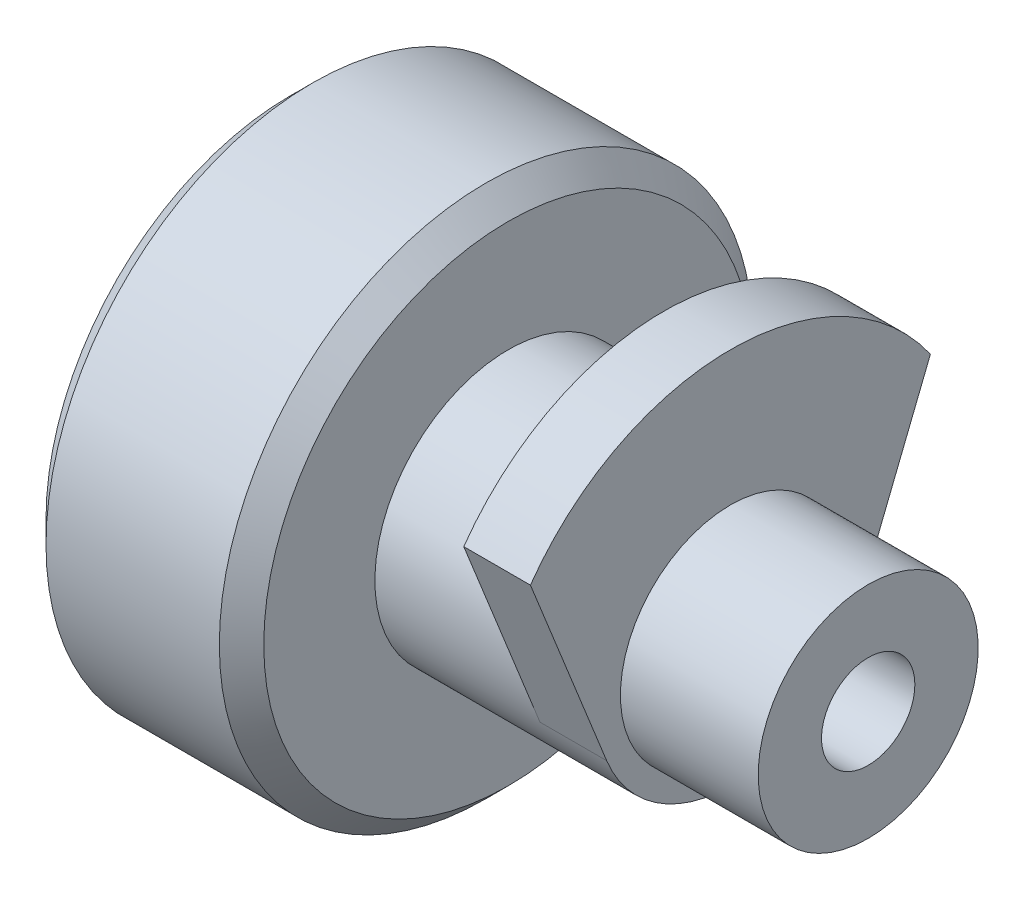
ISO-10303-21;
HEADER;
FILE_DESCRIPTION(('STEP AP214'),'2;1');
FILE_NAME('part.step','',(''),(''),'','','');
FILE_SCHEMA(('AUTOMOTIVE_DESIGN { 1 0 10303 214 1 1 1 1 }'));
ENDSEC;
DATA;
#1=APPLICATION_CONTEXT('core data for automotive mechanical design processes');
#2=APPLICATION_PROTOCOL_DEFINITION('international standard','automotive_design',2000,#1);
#3=PRODUCT_CONTEXT('',#1,'mechanical');
#4=PRODUCT('Part','Part','',(#3));
#5=PRODUCT_RELATED_PRODUCT_CATEGORY('part','',(#4));
#6=PRODUCT_DEFINITION_FORMATION('','',#4);
#7=PRODUCT_DEFINITION_CONTEXT('part definition',#1,'design');
#8=PRODUCT_DEFINITION('design','',#6,#7);
#9=PRODUCT_DEFINITION_SHAPE('','',#8);
#10=(LENGTH_UNIT() NAMED_UNIT(*) SI_UNIT(.MILLI.,.METRE.));
#11=(NAMED_UNIT(*) PLANE_ANGLE_UNIT() SI_UNIT($,.RADIAN.));
#12=(NAMED_UNIT(*) SI_UNIT($,.STERADIAN.) SOLID_ANGLE_UNIT());
#13=UNCERTAINTY_MEASURE_WITH_UNIT(LENGTH_MEASURE(1.E-05),#10,'distance_accuracy_value','');
#14=(GEOMETRIC_REPRESENTATION_CONTEXT(3) GLOBAL_UNCERTAINTY_ASSIGNED_CONTEXT((#13)) GLOBAL_UNIT_ASSIGNED_CONTEXT((#10,
#11,#12)) REPRESENTATION_CONTEXT('',''));
#15=CARTESIAN_POINT('',(0.,0.,0.));
#16=DIRECTION('',(0.,0.,1.));
#17=DIRECTION('',(1.,0.,0.));
#18=AXIS2_PLACEMENT_3D('',#15,#16,#17);
#19=CARTESIAN_POINT('',(16.8,0.,0.));
#20=DIRECTION('',(-1.,0.,0.));
#21=DIRECTION('',(0.,-1.,0.));
#22=AXIS2_PLACEMENT_3D('',#19,#20,#21);
#23=CYLINDRICAL_SURFACE('',#22,6.);
#24=CARTESIAN_POINT('',(9.8,0.,0.));
#25=DIRECTION('',(-1.,0.,0.));
#26=DIRECTION('',(0.,-1.,0.));
#27=AXIS2_PLACEMENT_3D('',#24,#25,#26);
#28=CIRCLE('',#27,6.);
#29=CARTESIAN_POINT('',(9.79999999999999,-5.99999999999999,0.));
#30=VERTEX_POINT('',#29);
#31=EDGE_CURVE('E128',#30,#30,#28,.T.);
#32=ORIENTED_EDGE('',*,*,#31,.F.);
#33=EDGE_LOOP('',(#32));
#34=FACE_BOUND('',#33,.T.);
#35=CARTESIAN_POINT('',(16.8,0.,0.));
#36=DIRECTION('',(1.,0.,0.));
#37=DIRECTION('',(0.,1.,0.));
#38=AXIS2_PLACEMENT_3D('',#35,#36,#37);
#39=CIRCLE('',#38,6.);
#40=CARTESIAN_POINT('',(16.8,-2.23282156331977,-5.56906705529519));
#41=VERTEX_POINT('',#40);
#42=CARTESIAN_POINT('',(16.8,-2.23282156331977,5.56906705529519));
#43=VERTEX_POINT('',#42);
#44=EDGE_CURVE('E51',#41,#43,#39,.T.);
#45=ORIENTED_EDGE('',*,*,#44,.F.);
#46=DIRECTION('',(1.,0.,0.));
#47=VECTOR('',#46,1.);
#48=CARTESIAN_POINT('',(16.8,-2.23282156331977,-5.56906705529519));
#49=LINE('',#48,#47);
#50=CARTESIAN_POINT('',(19.8,-2.23282156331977,-5.56906705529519));
#51=VERTEX_POINT('',#50);
#52=EDGE_CURVE('E103',#41,#51,#49,.T.);
#53=ORIENTED_EDGE('',*,*,#52,.T.);
#54=CARTESIAN_POINT('',(19.8,0.,0.));
#55=DIRECTION('',(-1.,0.,0.));
#56=DIRECTION('',(0.,-1.,0.));
#57=AXIS2_PLACEMENT_3D('',#54,#55,#56);
#58=CIRCLE('',#57,6.);
#59=CARTESIAN_POINT('',(19.8,-2.23282156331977,5.56906705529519));
#60=VERTEX_POINT('',#59);
#61=EDGE_CURVE('E131',#51,#60,#58,.T.);
#62=ORIENTED_EDGE('',*,*,#61,.T.);
#63=DIRECTION('',(1.,0.,0.));
#64=VECTOR('',#63,1.);
#65=CARTESIAN_POINT('',(16.8,-2.23282156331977,5.56906705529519));
#66=LINE('',#65,#64);
#67=EDGE_CURVE('E47',#43,#60,#66,.T.);
#68=ORIENTED_EDGE('',*,*,#67,.F.);
#69=EDGE_LOOP('',(#45,#53,#62,#68));
#70=FACE_BOUND('',#69,.T.);
#71=ADVANCED_FACE('F31',(#34,#70),#23,.T.);
#72=CARTESIAN_POINT('',(26.,0.,0.));
#73=DIRECTION('',(-1.,0.,0.));
#74=DIRECTION('',(0.,-1.,0.));
#75=AXIS2_PLACEMENT_3D('',#72,#73,#74);
#76=PLANE('',#75);
#77=CARTESIAN_POINT('',(26.,0.,0.));
#78=DIRECTION('',(1.,0.,0.));
#79=DIRECTION('',(0.,0.,-1.));
#80=AXIS2_PLACEMENT_3D('',#77,#78,#79);
#81=CIRCLE('',#80,2.09999999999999);
#82=CARTESIAN_POINT('',(26.,0.,-2.09999999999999));
#83=VERTEX_POINT('',#82);
#84=EDGE_CURVE('E107',#83,#83,#81,.T.);
#85=ORIENTED_EDGE('',*,*,#84,.F.);
#86=EDGE_LOOP('',(#85));
#87=FACE_BOUND('',#86,.T.);
#88=CARTESIAN_POINT('',(26.,0.,0.));
#89=DIRECTION('',(-1.,0.,0.));
#90=DIRECTION('',(0.,-1.,0.));
#91=AXIS2_PLACEMENT_3D('',#88,#89,#90);
#92=CIRCLE('',#91,4.95);
#93=CARTESIAN_POINT('',(26.,-4.95,0.));
#94=VERTEX_POINT('',#93);
#95=EDGE_CURVE('E11',#94,#94,#92,.T.);
#96=ORIENTED_EDGE('',*,*,#95,.F.);
#97=EDGE_LOOP('',(#96));
#98=FACE_BOUND('',#97,.T.);
#99=ADVANCED_FACE('F33',(#87,#98),#76,.F.);
#100=CARTESIAN_POINT('',(16.8,0.,0.));
#101=DIRECTION('',(-1.,0.,0.));
#102=DIRECTION('',(0.,-1.,0.));
#103=AXIS2_PLACEMENT_3D('',#100,#101,#102);
#104=CYLINDRICAL_SURFACE('',#103,4.95);
#105=CARTESIAN_POINT('',(19.8,0.,0.));
#106=DIRECTION('',(-1.,0.,0.));
#107=DIRECTION('',(0.,-1.,0.));
#108=AXIS2_PLACEMENT_3D('',#105,#106,#107);
#109=CIRCLE('',#108,4.95);
#110=CARTESIAN_POINT('',(19.8,-4.95,0.));
#111=VERTEX_POINT('',#110);
#112=EDGE_CURVE('E40',#111,#111,#109,.T.);
#113=ORIENTED_EDGE('',*,*,#112,.F.);
#114=EDGE_LOOP('',(#113));
#115=FACE_BOUND('',#114,.T.);
#116=ORIENTED_EDGE('',*,*,#95,.T.);
#117=EDGE_LOOP('',(#116));
#118=FACE_BOUND('',#117,.T.);
#119=ADVANCED_FACE('F138',(#115,#118),#104,.T.);
#120=CARTESIAN_POINT('',(19.8,4.95,0.));
#121=DIRECTION('',(-1.,0.,0.));
#122=DIRECTION('',(0.,-1.,0.));
#123=AXIS2_PLACEMENT_3D('',#120,#121,#122);
#124=PLANE('',#123);
#125=ORIENTED_EDGE('',*,*,#61,.F.);
#126=DIRECTION('',(0.,0.928177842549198,-0.372136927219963));
#127=VECTOR('',#126,1.);
#128=CARTESIAN_POINT('',(19.8,6.32455532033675,-9.));
#129=LINE('',#128,#127);
#130=CARTESIAN_POINT('',(19.8,6.32455532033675,-9.));
#131=VERTEX_POINT('',#130);
#132=EDGE_CURVE('E93',#51,#131,#129,.T.);
#133=ORIENTED_EDGE('',*,*,#132,.T.);
#134=CARTESIAN_POINT('',(19.8,0.,0.));
#135=DIRECTION('',(1.,0.,0.));
#136=DIRECTION('',(0.,1.,0.));
#137=AXIS2_PLACEMENT_3D('',#134,#135,#136);
#138=CIRCLE('',#137,11.);
#139=CARTESIAN_POINT('',(19.8,6.32455532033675,9.));
#140=VERTEX_POINT('',#139);
#141=EDGE_CURVE('E99',#131,#140,#138,.T.);
#142=ORIENTED_EDGE('',*,*,#141,.T.);
#143=DIRECTION('',(0.,-0.928177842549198,-0.372136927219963));
#144=VECTOR('',#143,1.);
#145=CARTESIAN_POINT('',(19.8,6.32455532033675,9.));
#146=LINE('',#145,#144);
#147=EDGE_CURVE('E77',#140,#60,#146,.T.);
#148=ORIENTED_EDGE('',*,*,#147,.T.);
#149=EDGE_LOOP('',(#125,#133,#142,#148));
#150=FACE_BOUND('',#149,.T.);
#151=ORIENTED_EDGE('',*,*,#112,.T.);
#152=EDGE_LOOP('',(#151));
#153=FACE_BOUND('',#152,.T.);
#154=ADVANCED_FACE('F136',(#150,#153),#124,.F.);
#155=CARTESIAN_POINT('',(9.8,6.,0.));
#156=DIRECTION('',(-1.,0.,0.));
#157=DIRECTION('',(0.,-1.,0.));
#158=AXIS2_PLACEMENT_3D('',#155,#156,#157);
#159=PLANE('',#158);
#160=CARTESIAN_POINT('',(9.8,0.,0.));
#161=DIRECTION('',(-1.,0.,0.));
#162=DIRECTION('',(0.,-1.,0.));
#163=AXIS2_PLACEMENT_3D('',#160,#161,#162);
#164=CIRCLE('',#163,11.);
#165=CARTESIAN_POINT('',(9.79999999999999,-11.,0.));
#166=VERTEX_POINT('',#165);
#167=EDGE_CURVE('E125',#166,#166,#164,.T.);
#168=ORIENTED_EDGE('',*,*,#167,.F.);
#169=EDGE_LOOP('',(#168));
#170=FACE_BOUND('',#169,.T.);
#171=ORIENTED_EDGE('',*,*,#31,.T.);
#172=EDGE_LOOP('',(#171));
#173=FACE_BOUND('',#172,.T.);
#174=ADVANCED_FACE('F189',(#170,#173),#159,.F.);
#175=CARTESIAN_POINT('',(9.8,0.,0.));
#176=DIRECTION('',(-1.,0.,0.));
#177=DIRECTION('',(0.,-1.,0.));
#178=AXIS2_PLACEMENT_3D('',#175,#176,#177);
#179=CONICAL_SURFACE('',#178,11.,0.785398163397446);
#180=CARTESIAN_POINT('',(8.79999999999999,0.,0.));
#181=DIRECTION('',(-1.,0.,0.));
#182=DIRECTION('',(0.,-1.,0.));
#183=AXIS2_PLACEMENT_3D('',#180,#181,#182);
#184=CIRCLE('',#183,12.);
#185=CARTESIAN_POINT('',(8.79999999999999,-12.,0.));
#186=VERTEX_POINT('',#185);
#187=EDGE_CURVE('E122',#186,#186,#184,.T.);
#188=ORIENTED_EDGE('',*,*,#187,.F.);
#189=EDGE_LOOP('',(#188));
#190=FACE_BOUND('',#189,.T.);
#191=ORIENTED_EDGE('',*,*,#167,.T.);
#192=EDGE_LOOP('',(#191));
#193=FACE_BOUND('',#192,.T.);
#194=ADVANCED_FACE('F185',(#190,#193),#179,.T.);
#195=CARTESIAN_POINT('',(16.8,0.,0.));
#196=DIRECTION('',(-1.,0.,0.));
#197=DIRECTION('',(0.,-1.,0.));
#198=AXIS2_PLACEMENT_3D('',#195,#196,#197);
#199=CYLINDRICAL_SURFACE('',#198,12.);
#200=CARTESIAN_POINT('',(0.99999999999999,0.,0.));
#201=DIRECTION('',(-1.,0.,0.));
#202=DIRECTION('',(0.,-1.,0.));
#203=AXIS2_PLACEMENT_3D('',#200,#201,#202);
#204=CIRCLE('',#203,12.);
#205=CARTESIAN_POINT('',(0.999999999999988,-12.,0.));
#206=VERTEX_POINT('',#205);
#207=EDGE_CURVE('E119',#206,#206,#204,.T.);
#208=ORIENTED_EDGE('',*,*,#207,.F.);
#209=EDGE_LOOP('',(#208));
#210=FACE_BOUND('',#209,.T.);
#211=ORIENTED_EDGE('',*,*,#187,.T.);
#212=EDGE_LOOP('',(#211));
#213=FACE_BOUND('',#212,.T.);
#214=ADVANCED_FACE('F181',(#210,#213),#199,.T.);
#215=CARTESIAN_POINT('',(0.99999999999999,0.,0.));
#216=DIRECTION('',(1.,0.,0.));
#217=DIRECTION('',(0.,1.,0.));
#218=AXIS2_PLACEMENT_3D('',#215,#216,#217);
#219=CONICAL_SURFACE('',#218,12.,0.785398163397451);
#220=CARTESIAN_POINT('',(0.,0.,0.));
#221=DIRECTION('',(-1.,0.,0.));
#222=DIRECTION('',(0.,-1.,0.));
#223=AXIS2_PLACEMENT_3D('',#220,#221,#222);
#224=CIRCLE('',#223,11.);
#225=CARTESIAN_POINT('',(0.,-11.,0.));
#226=VERTEX_POINT('',#225);
#227=EDGE_CURVE('E116',#226,#226,#224,.T.);
#228=ORIENTED_EDGE('',*,*,#227,.F.);
#229=EDGE_LOOP('',(#228));
#230=FACE_BOUND('',#229,.T.);
#231=ORIENTED_EDGE('',*,*,#207,.T.);
#232=EDGE_LOOP('',(#231));
#233=FACE_BOUND('',#232,.T.);
#234=ADVANCED_FACE('F177',(#230,#233),#219,.T.);
#235=CARTESIAN_POINT('',(0.,11.,0.));
#236=DIRECTION('',(1.,0.,0.));
#237=DIRECTION('',(0.,1.,0.));
#238=AXIS2_PLACEMENT_3D('',#235,#236,#237);
#239=PLANE('',#238);
#240=CARTESIAN_POINT('',(0.,0.,0.));
#241=DIRECTION('',(-1.,0.,0.));
#242=DIRECTION('',(0.,-1.,0.));
#243=AXIS2_PLACEMENT_3D('',#240,#241,#242);
#244=CIRCLE('',#243,2.5);
#245=CARTESIAN_POINT('',(0.,-2.49999999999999,0.));
#246=VERTEX_POINT('',#245);
#247=EDGE_CURVE('E113',#246,#246,#244,.T.);
#248=ORIENTED_EDGE('',*,*,#247,.F.);
#249=EDGE_LOOP('',(#248));
#250=FACE_BOUND('',#249,.T.);
#251=ORIENTED_EDGE('',*,*,#227,.T.);
#252=EDGE_LOOP('',(#251));
#253=FACE_BOUND('',#252,.T.);
#254=ADVANCED_FACE('F173',(#250,#253),#239,.F.);
#255=CARTESIAN_POINT('',(16.8,0.,0.));
#256=DIRECTION('',(-1.,0.,0.));
#257=DIRECTION('',(0.,-1.,0.));
#258=AXIS2_PLACEMENT_3D('',#255,#256,#257);
#259=CYLINDRICAL_SURFACE('',#258,2.5);
#260=CARTESIAN_POINT('',(16.8,0.,0.));
#261=DIRECTION('',(-1.,0.,0.));
#262=DIRECTION('',(0.,-1.,0.));
#263=AXIS2_PLACEMENT_3D('',#260,#261,#262);
#264=CIRCLE('',#263,2.5);
#265=CARTESIAN_POINT('',(16.8,-2.5,0.));
#266=VERTEX_POINT('',#265);
#267=EDGE_CURVE('E110',#266,#266,#264,.T.);
#268=ORIENTED_EDGE('',*,*,#267,.F.);
#269=EDGE_LOOP('',(#268));
#270=FACE_BOUND('',#269,.T.);
#271=ORIENTED_EDGE('',*,*,#247,.T.);
#272=EDGE_LOOP('',(#271));
#273=FACE_BOUND('',#272,.T.);
#274=ADVANCED_FACE('F164',(#270,#273),#259,.F.);
#275=CARTESIAN_POINT('',(16.8,2.5,0.));
#276=DIRECTION('',(1.,0.,0.));
#277=DIRECTION('',(0.,1.,0.));
#278=AXIS2_PLACEMENT_3D('',#275,#276,#277);
#279=PLANE('',#278);
#280=ORIENTED_EDGE('',*,*,#267,.T.);
#281=EDGE_LOOP('',(#280));
#282=FACE_BOUND('',#281,.T.);
#283=ADVANCED_FACE('F155',(#282),#279,.F.);
#284=CARTESIAN_POINT('',(26.,0.,0.));
#285=DIRECTION('',(1.,0.,0.));
#286=DIRECTION('',(0.,0.,-1.));
#287=AXIS2_PLACEMENT_3D('',#284,#285,#286);
#288=CYLINDRICAL_SURFACE('',#287,2.09999999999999);
#289=CARTESIAN_POINT('',(19.8,0.,0.));
#290=DIRECTION('',(1.,0.,0.));
#291=DIRECTION('',(0.,1.,0.));
#292=AXIS2_PLACEMENT_3D('',#289,#290,#291);
#293=CIRCLE('',#292,2.09999999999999);
#294=CARTESIAN_POINT('',(19.8,2.09999999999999,0.));
#295=VERTEX_POINT('',#294);
#296=EDGE_CURVE('E35',#295,#295,#293,.F.);
#297=ORIENTED_EDGE('',*,*,#296,.T.);
#298=EDGE_LOOP('',(#297));
#299=FACE_BOUND('',#298,.T.);
#300=ORIENTED_EDGE('',*,*,#84,.T.);
#301=EDGE_LOOP('',(#300));
#302=FACE_BOUND('',#301,.T.);
#303=ADVANCED_FACE('F152',(#299,#302),#288,.F.);
#304=CARTESIAN_POINT('',(19.8,0.,0.));
#305=DIRECTION('',(1.,0.,0.));
#306=DIRECTION('',(0.,1.,0.));
#307=AXIS2_PLACEMENT_3D('',#304,#305,#306);
#308=PLANE('',#307);
#309=ORIENTED_EDGE('',*,*,#296,.F.);
#310=EDGE_LOOP('',(#309));
#311=FACE_BOUND('',#310,.T.);
#312=ADVANCED_FACE('F154',(#311),#308,.T.);
#313=CARTESIAN_POINT('',(16.8,0.,0.));
#314=DIRECTION('',(1.,0.,0.));
#315=DIRECTION('',(0.,1.,0.));
#316=AXIS2_PLACEMENT_3D('',#313,#314,#315);
#317=PLANE('',#316);
#318=DIRECTION('',(0.,0.928177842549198,-0.372136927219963));
#319=VECTOR('',#318,1.);
#320=CARTESIAN_POINT('',(16.8,6.32455532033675,-9.));
#321=LINE('',#320,#319);
#322=CARTESIAN_POINT('',(16.8,6.32455532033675,-9.));
#323=VERTEX_POINT('',#322);
#324=EDGE_CURVE('E82',#41,#323,#321,.T.);
#325=ORIENTED_EDGE('',*,*,#324,.F.);
#326=ORIENTED_EDGE('',*,*,#44,.T.);
#327=DIRECTION('',(0.,-0.928177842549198,-0.372136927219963));
#328=VECTOR('',#327,1.);
#329=CARTESIAN_POINT('',(16.8,6.32455532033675,9.));
#330=LINE('',#329,#328);
#331=CARTESIAN_POINT('',(16.8,6.32455532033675,9.));
#332=VERTEX_POINT('',#331);
#333=EDGE_CURVE('E75',#332,#43,#330,.T.);
#334=ORIENTED_EDGE('',*,*,#333,.F.);
#335=CARTESIAN_POINT('',(16.8,0.,0.));
#336=DIRECTION('',(1.,0.,0.));
#337=DIRECTION('',(0.,1.,0.));
#338=AXIS2_PLACEMENT_3D('',#335,#336,#337);
#339=CIRCLE('',#338,11.);
#340=EDGE_CURVE('E88',#323,#332,#339,.T.);
#341=ORIENTED_EDGE('',*,*,#340,.F.);
#342=EDGE_LOOP('',(#325,#326,#334,#341));
#343=FACE_BOUND('',#342,.T.);
#344=ADVANCED_FACE('F87',(#343),#317,.F.);
#345=CARTESIAN_POINT('',(16.8,0.,0.));
#346=DIRECTION('',(1.,0.,0.));
#347=DIRECTION('',(0.,1.,0.));
#348=AXIS2_PLACEMENT_3D('',#345,#346,#347);
#349=CYLINDRICAL_SURFACE('',#348,11.);
#350=ORIENTED_EDGE('',*,*,#141,.F.);
#351=DIRECTION('',(1.,0.,0.));
#352=VECTOR('',#351,1.);
#353=CARTESIAN_POINT('',(16.8,6.32455532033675,-9.));
#354=LINE('',#353,#352);
#355=EDGE_CURVE('E92',#323,#131,#354,.T.);
#356=ORIENTED_EDGE('',*,*,#355,.F.);
#357=ORIENTED_EDGE('',*,*,#340,.T.);
#358=DIRECTION('',(1.,0.,0.));
#359=VECTOR('',#358,1.);
#360=CARTESIAN_POINT('',(16.8,6.32455532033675,9.));
#361=LINE('',#360,#359);
#362=EDGE_CURVE('E72',#332,#140,#361,.T.);
#363=ORIENTED_EDGE('',*,*,#362,.T.);
#364=EDGE_LOOP('',(#350,#356,#357,#363));
#365=FACE_BOUND('',#364,.T.);
#366=ADVANCED_FACE('F91',(#365),#349,.T.);
#367=CARTESIAN_POINT('',(16.8,6.32455532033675,-9.));
#368=DIRECTION('',(0.,-0.372136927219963,-0.928177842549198));
#369=DIRECTION('',(0.,0.928177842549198,-0.372136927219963));
#370=AXIS2_PLACEMENT_3D('',#367,#368,#369);
#371=PLANE('',#370);
#372=ORIENTED_EDGE('',*,*,#132,.F.);
#373=ORIENTED_EDGE('',*,*,#52,.F.);
#374=ORIENTED_EDGE('',*,*,#324,.T.);
#375=ORIENTED_EDGE('',*,*,#355,.T.);
#376=EDGE_LOOP('',(#372,#373,#374,#375));
#377=FACE_BOUND('',#376,.T.);
#378=ADVANCED_FACE('F200',(#377),#371,.T.);
#379=CARTESIAN_POINT('',(16.8,6.32455532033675,9.));
#380=DIRECTION('',(0.,-0.372136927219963,0.928177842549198));
#381=DIRECTION('',(0.,-0.928177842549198,-0.372136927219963));
#382=AXIS2_PLACEMENT_3D('',#379,#380,#381);
#383=PLANE('',#382);
#384=ORIENTED_EDGE('',*,*,#147,.F.);
#385=ORIENTED_EDGE('',*,*,#362,.F.);
#386=ORIENTED_EDGE('',*,*,#333,.T.);
#387=ORIENTED_EDGE('',*,*,#67,.T.);
#388=EDGE_LOOP('',(#384,#385,#386,#387));
#389=FACE_BOUND('',#388,.T.);
#390=ADVANCED_FACE('F74',(#389),#383,.T.);
#391=CLOSED_SHELL('',(#71,#99,#119,#154,#174,#194,#214,#234,#254,#274,#283,#303,#312,#344,#366,
#378,#390));
#392=MANIFOLD_SOLID_BREP('B2',#391);
#393=ADVANCED_BREP_SHAPE_REPRESENTATION('',(#18,#392),#14);
#394=SHAPE_DEFINITION_REPRESENTATION(#9,#393);
ENDSEC;
END-ISO-10303-21;
